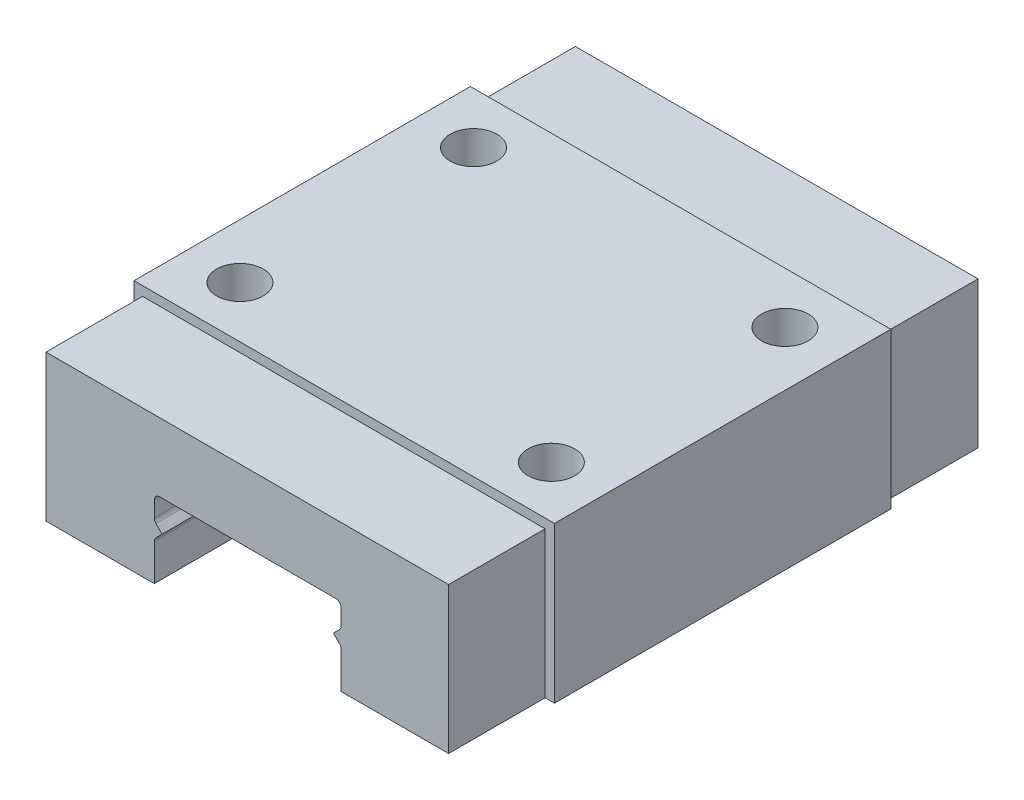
ISO-10303-21;
HEADER;
FILE_DESCRIPTION(('STEP AP214'),'2;1');
FILE_NAME('part.step','',(''),(''),'','','');
FILE_SCHEMA(('AUTOMOTIVE_DESIGN { 1 0 10303 214 1 1 1 1 }'));
ENDSEC;
DATA;
#1=APPLICATION_CONTEXT('core data for automotive mechanical design processes');
#2=APPLICATION_PROTOCOL_DEFINITION('international standard','automotive_design',2000,#1);
#3=PRODUCT_CONTEXT('',#1,'mechanical');
#4=PRODUCT('Part','Part','',(#3));
#5=PRODUCT_RELATED_PRODUCT_CATEGORY('part','',(#4));
#6=PRODUCT_DEFINITION_FORMATION('','',#4);
#7=PRODUCT_DEFINITION_CONTEXT('part definition',#1,'design');
#8=PRODUCT_DEFINITION('design','',#6,#7);
#9=PRODUCT_DEFINITION_SHAPE('','',#8);
#10=(LENGTH_UNIT() NAMED_UNIT(*) SI_UNIT(.MILLI.,.METRE.));
#11=(NAMED_UNIT(*) PLANE_ANGLE_UNIT() SI_UNIT($,.RADIAN.));
#12=(NAMED_UNIT(*) SI_UNIT($,.STERADIAN.) SOLID_ANGLE_UNIT());
#13=UNCERTAINTY_MEASURE_WITH_UNIT(LENGTH_MEASURE(1.E-05),#10,'distance_accuracy_value','');
#14=(GEOMETRIC_REPRESENTATION_CONTEXT(3) GLOBAL_UNCERTAINTY_ASSIGNED_CONTEXT((#13)) GLOBAL_UNIT_ASSIGNED_CONTEXT((#10,
#11,#12)) REPRESENTATION_CONTEXT('',''));
#15=CARTESIAN_POINT('',(0.,0.,0.));
#16=DIRECTION('',(0.,0.,1.));
#17=DIRECTION('',(1.,0.,0.));
#18=AXIS2_PLACEMENT_3D('',#15,#16,#17);
#19=CARTESIAN_POINT('',(-13.5,13.,34.));
#20=DIRECTION('',(1.,0.,0.));
#21=DIRECTION('',(0.,0.,-1.));
#22=AXIS2_PLACEMENT_3D('',#19,#20,#21);
#23=PLANE('',#22);
#24=DIRECTION('',(0.,-1.,0.));
#25=VECTOR('',#24,1.);
#26=CARTESIAN_POINT('',(-13.5,13.,27.8));
#27=LINE('',#26,#25);
#28=CARTESIAN_POINT('',(-13.5,13.,27.8));
#29=VERTEX_POINT('',#28);
#30=CARTESIAN_POINT('',(-13.5,3.,27.8));
#31=VERTEX_POINT('',#30);
#32=EDGE_CURVE('E462',#29,#31,#27,.T.);
#33=ORIENTED_EDGE('',*,*,#32,.F.);
#34=DIRECTION('',(0.,0.,-1.));
#35=VECTOR('',#34,1.);
#36=CARTESIAN_POINT('',(-13.5,13.,34.));
#37=LINE('',#36,#35);
#38=CARTESIAN_POINT('',(-13.5,13.,6.2));
#39=VERTEX_POINT('',#38);
#40=EDGE_CURVE('E56',#29,#39,#37,.T.);
#41=ORIENTED_EDGE('',*,*,#40,.T.);
#42=DIRECTION('',(0.,1.,0.));
#43=VECTOR('',#42,1.);
#44=CARTESIAN_POINT('',(-13.5,13.,6.2));
#45=LINE('',#44,#43);
#46=CARTESIAN_POINT('',(-13.5,3.,6.2));
#47=VERTEX_POINT('',#46);
#48=EDGE_CURVE('E479',#47,#39,#45,.T.);
#49=ORIENTED_EDGE('',*,*,#48,.F.);
#50=DIRECTION('',(0.,0.,-1.));
#51=VECTOR('',#50,1.);
#52=CARTESIAN_POINT('',(-13.5,3.,34.));
#53=LINE('',#52,#51);
#54=EDGE_CURVE('E267',#31,#47,#53,.T.);
#55=ORIENTED_EDGE('',*,*,#54,.F.);
#56=EDGE_LOOP('',(#33,#41,#49,#55));
#57=FACE_BOUND('',#56,.T.);
#58=ADVANCED_FACE('F34',(#57),#23,.F.);
#59=CARTESIAN_POINT('',(13.5,13.,34.));
#60=DIRECTION('',(-1.,0.,0.));
#61=DIRECTION('',(0.,0.,1.));
#62=AXIS2_PLACEMENT_3D('',#59,#60,#61);
#63=PLANE('',#62);
#64=DIRECTION('',(0.,1.,0.));
#65=VECTOR('',#64,1.);
#66=CARTESIAN_POINT('',(13.5,13.,27.8));
#67=LINE('',#66,#65);
#68=CARTESIAN_POINT('',(13.5,3.,27.8));
#69=VERTEX_POINT('',#68);
#70=CARTESIAN_POINT('',(13.5,13.,27.8));
#71=VERTEX_POINT('',#70);
#72=EDGE_CURVE('E1008',#69,#71,#67,.T.);
#73=ORIENTED_EDGE('',*,*,#72,.F.);
#74=DIRECTION('',(0.,0.,-1.));
#75=VECTOR('',#74,1.);
#76=CARTESIAN_POINT('',(13.5,3.,34.));
#77=LINE('',#76,#75);
#78=CARTESIAN_POINT('',(13.5,3.,6.2));
#79=VERTEX_POINT('',#78);
#80=EDGE_CURVE('E265',#69,#79,#77,.T.);
#81=ORIENTED_EDGE('',*,*,#80,.T.);
#82=DIRECTION('',(0.,-1.,0.));
#83=VECTOR('',#82,1.);
#84=CARTESIAN_POINT('',(13.5,13.,6.2));
#85=LINE('',#84,#83);
#86=CARTESIAN_POINT('',(13.5,13.,6.2));
#87=VERTEX_POINT('',#86);
#88=EDGE_CURVE('E476',#87,#79,#85,.T.);
#89=ORIENTED_EDGE('',*,*,#88,.F.);
#90=DIRECTION('',(0.,0.,-1.));
#91=VECTOR('',#90,1.);
#92=CARTESIAN_POINT('',(13.5,13.,34.));
#93=LINE('',#92,#91);
#94=EDGE_CURVE('E257',#71,#87,#93,.T.);
#95=ORIENTED_EDGE('',*,*,#94,.F.);
#96=EDGE_LOOP('',(#73,#81,#89,#95));
#97=FACE_BOUND('',#96,.T.);
#98=ADVANCED_FACE('F454',(#97),#63,.F.);
#99=CARTESIAN_POINT('',(-13.5,13.,34.));
#100=DIRECTION('',(0.,-1.,0.));
#101=DIRECTION('',(0.,0.,-1.));
#102=AXIS2_PLACEMENT_3D('',#99,#100,#101);
#103=PLANE('',#102);
#104=CARTESIAN_POINT('',(10.,13.,24.5));
#105=DIRECTION('',(0.,1.,0.));
#106=DIRECTION('',(0.,0.,1.));
#107=AXIS2_PLACEMENT_3D('',#104,#105,#106);
#108=CIRCLE('',#107,1.5);
#109=CARTESIAN_POINT('',(10.,13.,26.));
#110=VERTEX_POINT('',#109);
#111=EDGE_CURVE('E502',#110,#110,#108,.T.);
#112=ORIENTED_EDGE('',*,*,#111,.F.);
#113=EDGE_LOOP('',(#112));
#114=FACE_BOUND('',#113,.T.);
#115=CARTESIAN_POINT('',(10.,13.,9.5));
#116=DIRECTION('',(0.,1.,0.));
#117=DIRECTION('',(0.,0.,1.));
#118=AXIS2_PLACEMENT_3D('',#115,#116,#117);
#119=CIRCLE('',#118,1.5);
#120=CARTESIAN_POINT('',(10.,13.,11.));
#121=VERTEX_POINT('',#120);
#122=EDGE_CURVE('E514',#121,#121,#119,.T.);
#123=ORIENTED_EDGE('',*,*,#122,.F.);
#124=EDGE_LOOP('',(#123));
#125=FACE_BOUND('',#124,.T.);
#126=CARTESIAN_POINT('',(-10.,13.,24.5));
#127=DIRECTION('',(0.,1.,0.));
#128=DIRECTION('',(0.,0.,1.));
#129=AXIS2_PLACEMENT_3D('',#126,#127,#128);
#130=CIRCLE('',#129,1.5);
#131=CARTESIAN_POINT('',(-10.,13.,26.));
#132=VERTEX_POINT('',#131);
#133=EDGE_CURVE('E526',#132,#132,#130,.T.);
#134=ORIENTED_EDGE('',*,*,#133,.F.);
#135=EDGE_LOOP('',(#134));
#136=FACE_BOUND('',#135,.T.);
#137=CARTESIAN_POINT('',(-10.,13.,9.5));
#138=DIRECTION('',(0.,1.,0.));
#139=DIRECTION('',(0.,0.,1.));
#140=AXIS2_PLACEMENT_3D('',#137,#138,#139);
#141=CIRCLE('',#140,1.5);
#142=CARTESIAN_POINT('',(-10.,13.,11.));
#143=VERTEX_POINT('',#142);
#144=EDGE_CURVE('E338',#143,#143,#141,.T.);
#145=ORIENTED_EDGE('',*,*,#144,.F.);
#146=EDGE_LOOP('',(#145));
#147=FACE_BOUND('',#146,.T.);
#148=DIRECTION('',(-1.,0.,0.));
#149=VECTOR('',#148,1.);
#150=CARTESIAN_POINT('',(-13.5,13.,27.8));
#151=LINE('',#150,#149);
#152=EDGE_CURVE('E465',#71,#29,#151,.T.);
#153=ORIENTED_EDGE('',*,*,#152,.F.);
#154=ORIENTED_EDGE('',*,*,#94,.T.);
#155=DIRECTION('',(1.,0.,0.));
#156=VECTOR('',#155,1.);
#157=CARTESIAN_POINT('',(-13.5,13.,6.2));
#158=LINE('',#157,#156);
#159=EDGE_CURVE('E472',#39,#87,#158,.T.);
#160=ORIENTED_EDGE('',*,*,#159,.F.);
#161=ORIENTED_EDGE('',*,*,#40,.F.);
#162=EDGE_LOOP('',(#153,#154,#160,#161));
#163=FACE_BOUND('',#162,.T.);
#164=ADVANCED_FACE('F458',(#114,#125,#136,#147,#163),#103,.F.);
#165=CARTESIAN_POINT('',(-13.5,3.,34.));
#166=DIRECTION('',(0.,1.,0.));
#167=DIRECTION('',(0.,0.,1.));
#168=AXIS2_PLACEMENT_3D('',#165,#166,#167);
#169=PLANE('',#168);
#170=DIRECTION('',(1.,0.,0.));
#171=VECTOR('',#170,1.);
#172=CARTESIAN_POINT('',(-13.5,3.,34.));
#173=LINE('',#172,#171);
#174=CARTESIAN_POINT('',(6.,3.,34.));
#175=VERTEX_POINT('',#174);
#176=CARTESIAN_POINT('',(12.9,3.,34.));
#177=VERTEX_POINT('',#176);
#178=EDGE_CURVE('E255',#175,#177,#173,.T.);
#179=ORIENTED_EDGE('',*,*,#178,.F.);
#180=DIRECTION('',(0.,0.,1.));
#181=VECTOR('',#180,1.);
#182=CARTESIAN_POINT('',(6.,3.,34.));
#183=LINE('',#182,#181);
#184=CARTESIAN_POINT('',(6.,3.,0.));
#185=VERTEX_POINT('',#184);
#186=EDGE_CURVE('E363',#185,#175,#183,.T.);
#187=ORIENTED_EDGE('',*,*,#186,.F.);
#188=DIRECTION('',(1.,0.,0.));
#189=VECTOR('',#188,1.);
#190=CARTESIAN_POINT('',(-13.5,3.,0.));
#191=LINE('',#190,#189);
#192=CARTESIAN_POINT('',(12.9,3.,0.));
#193=VERTEX_POINT('',#192);
#194=EDGE_CURVE('E391',#185,#193,#191,.T.);
#195=ORIENTED_EDGE('',*,*,#194,.T.);
#196=DIRECTION('',(0.,0.,-1.));
#197=VECTOR('',#196,1.);
#198=CARTESIAN_POINT('',(12.9,3.,6.2));
#199=LINE('',#198,#197);
#200=CARTESIAN_POINT('',(12.9,3.,6.2));
#201=VERTEX_POINT('',#200);
#202=EDGE_CURVE('E484',#201,#193,#199,.T.);
#203=ORIENTED_EDGE('',*,*,#202,.F.);
#204=DIRECTION('',(-1.,0.,0.));
#205=VECTOR('',#204,1.);
#206=CARTESIAN_POINT('',(-13.5,3.,6.2));
#207=LINE('',#206,#205);
#208=EDGE_CURVE('E488',#79,#201,#207,.T.);
#209=ORIENTED_EDGE('',*,*,#208,.F.);
#210=ORIENTED_EDGE('',*,*,#80,.F.);
#211=DIRECTION('',(1.,0.,0.));
#212=VECTOR('',#211,1.);
#213=CARTESIAN_POINT('',(-13.5,3.,27.8));
#214=LINE('',#213,#212);
#215=CARTESIAN_POINT('',(12.9,3.,27.8));
#216=VERTEX_POINT('',#215);
#217=EDGE_CURVE('E1003',#216,#69,#214,.T.);
#218=ORIENTED_EDGE('',*,*,#217,.F.);
#219=DIRECTION('',(0.,0.,1.));
#220=VECTOR('',#219,1.);
#221=CARTESIAN_POINT('',(12.9,3.,27.8));
#222=LINE('',#221,#220);
#223=EDGE_CURVE('E237',#216,#177,#222,.T.);
#224=ORIENTED_EDGE('',*,*,#223,.T.);
#225=EDGE_LOOP('',(#179,#187,#195,#203,#209,#210,#218,#224));
#226=FACE_BOUND('',#225,.T.);
#227=ADVANCED_FACE('F549',(#226),#169,.F.);
#228=CARTESIAN_POINT('',(-13.5,3.,0.));
#229=DIRECTION('',(0.,0.,1.));
#230=DIRECTION('',(1.,0.,0.));
#231=AXIS2_PLACEMENT_3D('',#228,#229,#230);
#232=PLANE('',#231);
#233=DIRECTION('',(0.,-1.,0.));
#234=VECTOR('',#233,1.);
#235=CARTESIAN_POINT('',(12.9,12.4,0.));
#236=LINE('',#235,#234);
#237=CARTESIAN_POINT('',(12.9,12.4,0.));
#238=VERTEX_POINT('',#237);
#239=EDGE_CURVE('E1012',#238,#193,#236,.T.);
#240=ORIENTED_EDGE('',*,*,#239,.T.);
#241=ORIENTED_EDGE('',*,*,#194,.F.);
#242=DIRECTION('',(0.,1.,0.));
#243=VECTOR('',#242,1.);
#244=CARTESIAN_POINT('',(6.,0.830210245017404,0.));
#245=LINE('',#244,#243);
#246=CARTESIAN_POINT('',(6.,5.35502525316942,0.));
#247=VERTEX_POINT('',#246);
#248=EDGE_CURVE('E356',#185,#247,#245,.T.);
#249=ORIENTED_EDGE('',*,*,#248,.T.);
#250=CARTESIAN_POINT('',(5.65,5.35502525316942,0.));
#251=DIRECTION('',(0.,0.,1.));
#252=DIRECTION('',(1.,0.,0.));
#253=AXIS2_PLACEMENT_3D('',#250,#251,#252);
#254=CIRCLE('',#253,0.35);
#255=CARTESIAN_POINT('',(5.89748737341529,5.60251262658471,0.));
#256=VERTEX_POINT('',#255);
#257=EDGE_CURVE('E314',#247,#256,#254,.T.);
#258=ORIENTED_EDGE('',*,*,#257,.T.);
#259=DIRECTION('',(-0.707106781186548,0.707106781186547,0.));
#260=VECTOR('',#259,1.);
#261=CARTESIAN_POINT('',(5.5,6.,0.));
#262=LINE('',#261,#260);
#263=CARTESIAN_POINT('',(5.5,6.,0.));
#264=VERTEX_POINT('',#263);
#265=EDGE_CURVE('E541',#256,#264,#262,.T.);
#266=ORIENTED_EDGE('',*,*,#265,.T.);
#267=DIRECTION('',(0.707106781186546,0.707106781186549,0.));
#268=VECTOR('',#267,1.);
#269=CARTESIAN_POINT('',(6.,6.5,0.));
#270=LINE('',#269,#268);
#271=CARTESIAN_POINT('',(5.89748737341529,6.39748737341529,0.));
#272=VERTEX_POINT('',#271);
#273=EDGE_CURVE('E329',#264,#272,#270,.T.);
#274=ORIENTED_EDGE('',*,*,#273,.T.);
#275=CARTESIAN_POINT('',(5.65,6.64497474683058,0.));
#276=DIRECTION('',(0.,0.,1.));
#277=DIRECTION('',(1.,0.,0.));
#278=AXIS2_PLACEMENT_3D('',#275,#276,#277);
#279=CIRCLE('',#278,0.35);
#280=CARTESIAN_POINT('',(6.,6.64497474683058,0.));
#281=VERTEX_POINT('',#280);
#282=EDGE_CURVE('E41',#272,#281,#279,.T.);
#283=ORIENTED_EDGE('',*,*,#282,.T.);
#284=DIRECTION('',(0.,1.,0.));
#285=VECTOR('',#284,1.);
#286=CARTESIAN_POINT('',(6.,8.,0.));
#287=LINE('',#286,#285);
#288=CARTESIAN_POINT('',(6.,7.65,0.));
#289=VERTEX_POINT('',#288);
#290=EDGE_CURVE('E327',#281,#289,#287,.T.);
#291=ORIENTED_EDGE('',*,*,#290,.T.);
#292=CARTESIAN_POINT('',(5.65,7.65,0.));
#293=DIRECTION('',(0.,0.,1.));
#294=DIRECTION('',(1.,0.,0.));
#295=AXIS2_PLACEMENT_3D('',#292,#293,#294);
#296=CIRCLE('',#295,0.35);
#297=CARTESIAN_POINT('',(5.65,8.,0.));
#298=VERTEX_POINT('',#297);
#299=EDGE_CURVE('E318',#289,#298,#296,.T.);
#300=ORIENTED_EDGE('',*,*,#299,.T.);
#301=DIRECTION('',(1.,0.,0.));
#302=VECTOR('',#301,1.);
#303=CARTESIAN_POINT('',(0.,8.,0.));
#304=LINE('',#303,#302);
#305=CARTESIAN_POINT('',(-5.65,8.,0.));
#306=VERTEX_POINT('',#305);
#307=EDGE_CURVE('E373',#306,#298,#304,.T.);
#308=ORIENTED_EDGE('',*,*,#307,.F.);
#309=CARTESIAN_POINT('',(-5.65,7.65,0.));
#310=DIRECTION('',(0.,0.,1.));
#311=DIRECTION('',(1.,0.,0.));
#312=AXIS2_PLACEMENT_3D('',#309,#310,#311);
#313=CIRCLE('',#312,0.35);
#314=CARTESIAN_POINT('',(-6.,7.65,0.));
#315=VERTEX_POINT('',#314);
#316=EDGE_CURVE('E291',#306,#315,#313,.T.);
#317=ORIENTED_EDGE('',*,*,#316,.T.);
#318=DIRECTION('',(0.,1.,0.));
#319=VECTOR('',#318,1.);
#320=CARTESIAN_POINT('',(-6.,8.,0.));
#321=LINE('',#320,#319);
#322=CARTESIAN_POINT('',(-6.,6.64497474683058,0.));
#323=VERTEX_POINT('',#322);
#324=EDGE_CURVE('E370',#323,#315,#321,.T.);
#325=ORIENTED_EDGE('',*,*,#324,.F.);
#326=CARTESIAN_POINT('',(-5.65,6.64497474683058,0.));
#327=DIRECTION('',(0.,0.,1.));
#328=DIRECTION('',(1.,0.,0.));
#329=AXIS2_PLACEMENT_3D('',#326,#327,#328);
#330=CIRCLE('',#329,0.35);
#331=CARTESIAN_POINT('',(-5.89748737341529,6.39748737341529,0.));
#332=VERTEX_POINT('',#331);
#333=EDGE_CURVE('E295',#323,#332,#330,.T.);
#334=ORIENTED_EDGE('',*,*,#333,.T.);
#335=DIRECTION('',(-0.707106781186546,0.707106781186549,0.));
#336=VECTOR('',#335,1.);
#337=CARTESIAN_POINT('',(-6.,6.5,0.));
#338=LINE('',#337,#336);
#339=CARTESIAN_POINT('',(-5.5,6.,0.));
#340=VERTEX_POINT('',#339);
#341=EDGE_CURVE('E367',#340,#332,#338,.T.);
#342=ORIENTED_EDGE('',*,*,#341,.F.);
#343=DIRECTION('',(0.707106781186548,0.707106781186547,0.));
#344=VECTOR('',#343,1.);
#345=CARTESIAN_POINT('',(-5.5,6.,0.));
#346=LINE('',#345,#344);
#347=CARTESIAN_POINT('',(-5.89748737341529,5.60251262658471,0.));
#348=VERTEX_POINT('',#347);
#349=EDGE_CURVE('E365',#348,#340,#346,.T.);
#350=ORIENTED_EDGE('',*,*,#349,.F.);
#351=CARTESIAN_POINT('',(-5.65,5.35502525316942,0.));
#352=DIRECTION('',(0.,0.,1.));
#353=DIRECTION('',(1.,0.,0.));
#354=AXIS2_PLACEMENT_3D('',#351,#352,#353);
#355=CIRCLE('',#354,0.35);
#356=CARTESIAN_POINT('',(-6.,5.35502525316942,0.));
#357=VERTEX_POINT('',#356);
#358=EDGE_CURVE('E287',#348,#357,#355,.T.);
#359=ORIENTED_EDGE('',*,*,#358,.T.);
#360=DIRECTION('',(0.,-1.,0.));
#361=VECTOR('',#360,1.);
#362=CARTESIAN_POINT('',(-6.,3.,0.));
#363=LINE('',#362,#361);
#364=CARTESIAN_POINT('',(-6.,3.,0.));
#365=VERTEX_POINT('',#364);
#366=EDGE_CURVE('E269',#357,#365,#363,.T.);
#367=ORIENTED_EDGE('',*,*,#366,.T.);
#368=CARTESIAN_POINT('',(-12.9556650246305,3.,0.));
#369=VERTEX_POINT('',#368);
#370=EDGE_CURVE('E260',#369,#365,#191,.T.);
#371=ORIENTED_EDGE('',*,*,#370,.F.);
#372=DIRECTION('',(0.,1.,0.));
#373=VECTOR('',#372,1.);
#374=CARTESIAN_POINT('',(-12.9556650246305,12.4,0.));
#375=LINE('',#374,#373);
#376=CARTESIAN_POINT('',(-12.9556650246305,12.4,0.));
#377=VERTEX_POINT('',#376);
#378=EDGE_CURVE('E1014',#369,#377,#375,.T.);
#379=ORIENTED_EDGE('',*,*,#378,.T.);
#380=DIRECTION('',(1.,0.,0.));
#381=VECTOR('',#380,1.);
#382=CARTESIAN_POINT('',(12.9,12.4,0.));
#383=LINE('',#382,#381);
#384=EDGE_CURVE('E1016',#377,#238,#383,.T.);
#385=ORIENTED_EDGE('',*,*,#384,.T.);
#386=EDGE_LOOP('',(#240,#241,#249,#258,#266,#274,#283,#291,#300,#308,#317,#325,#334,#342,#350,
#359,#367,#371,#379,#385));
#387=FACE_BOUND('',#386,.T.);
#388=ADVANCED_FACE('F326',(#387),#232,.F.);
#389=DIRECTION('',(0.,0.,1.));
#390=VECTOR('',#389,1.);
#391=CARTESIAN_POINT('',(-12.9556650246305,3.,27.8));
#392=LINE('',#391,#390);
#393=CARTESIAN_POINT('',(-12.9556650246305,3.,27.8));
#394=VERTEX_POINT('',#393);
#395=CARTESIAN_POINT('',(-12.9556650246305,3.,34.));
#396=VERTEX_POINT('',#395);
#397=EDGE_CURVE('E230',#394,#396,#392,.T.);
#398=ORIENTED_EDGE('',*,*,#397,.F.);
#399=DIRECTION('',(1.,0.,0.));
#400=VECTOR('',#399,1.);
#401=CARTESIAN_POINT('',(-13.5,3.,27.8));
#402=LINE('',#401,#400);
#403=EDGE_CURVE('E464',#31,#394,#402,.T.);
#404=ORIENTED_EDGE('',*,*,#403,.F.);
#405=ORIENTED_EDGE('',*,*,#54,.T.);
#406=DIRECTION('',(-1.,0.,0.));
#407=VECTOR('',#406,1.);
#408=CARTESIAN_POINT('',(-13.5,3.,6.2));
#409=LINE('',#408,#407);
#410=CARTESIAN_POINT('',(-12.9556650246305,3.,6.2));
#411=VERTEX_POINT('',#410);
#412=EDGE_CURVE('E490',#411,#47,#409,.T.);
#413=ORIENTED_EDGE('',*,*,#412,.F.);
#414=DIRECTION('',(0.,0.,-1.));
#415=VECTOR('',#414,1.);
#416=CARTESIAN_POINT('',(-12.9556650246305,3.,6.2));
#417=LINE('',#416,#415);
#418=EDGE_CURVE('E401',#411,#369,#417,.T.);
#419=ORIENTED_EDGE('',*,*,#418,.T.);
#420=ORIENTED_EDGE('',*,*,#370,.T.);
#421=DIRECTION('',(0.,0.,1.));
#422=VECTOR('',#421,1.);
#423=CARTESIAN_POINT('',(-6.,3.,34.));
#424=LINE('',#423,#422);
#425=CARTESIAN_POINT('',(-6.,3.,34.));
#426=VERTEX_POINT('',#425);
#427=EDGE_CURVE('E254',#365,#426,#424,.T.);
#428=ORIENTED_EDGE('',*,*,#427,.T.);
#429=EDGE_CURVE('E246',#396,#426,#173,.T.);
#430=ORIENTED_EDGE('',*,*,#429,.F.);
#431=EDGE_LOOP('',(#398,#404,#405,#413,#419,#420,#428,#430));
#432=FACE_BOUND('',#431,.T.);
#433=ADVANCED_FACE('F252',(#432),#169,.F.);
#434=CARTESIAN_POINT('',(-13.5,3.,34.));
#435=DIRECTION('',(0.,0.,1.));
#436=DIRECTION('',(1.,0.,0.));
#437=AXIS2_PLACEMENT_3D('',#434,#435,#436);
#438=PLANE('',#437);
#439=DIRECTION('',(0.,-1.,0.));
#440=VECTOR('',#439,1.);
#441=CARTESIAN_POINT('',(12.9,12.4,34.));
#442=LINE('',#441,#440);
#443=CARTESIAN_POINT('',(12.9,12.4,34.));
#444=VERTEX_POINT('',#443);
#445=EDGE_CURVE('E553',#444,#177,#442,.T.);
#446=ORIENTED_EDGE('',*,*,#445,.F.);
#447=DIRECTION('',(1.,0.,0.));
#448=VECTOR('',#447,1.);
#449=CARTESIAN_POINT('',(12.9,12.4,34.));
#450=LINE('',#449,#448);
#451=CARTESIAN_POINT('',(-12.9556650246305,12.4,34.));
#452=VERTEX_POINT('',#451);
#453=EDGE_CURVE('E249',#452,#444,#450,.T.);
#454=ORIENTED_EDGE('',*,*,#453,.F.);
#455=DIRECTION('',(0.,1.,0.));
#456=VECTOR('',#455,1.);
#457=CARTESIAN_POINT('',(-12.9556650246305,12.4,34.));
#458=LINE('',#457,#456);
#459=EDGE_CURVE('E48',#396,#452,#458,.T.);
#460=ORIENTED_EDGE('',*,*,#459,.F.);
#461=ORIENTED_EDGE('',*,*,#429,.T.);
#462=DIRECTION('',(0.,1.,0.));
#463=VECTOR('',#462,1.);
#464=CARTESIAN_POINT('',(-6.,0.830210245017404,34.));
#465=LINE('',#464,#463);
#466=CARTESIAN_POINT('',(-6.,5.35502525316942,34.));
#467=VERTEX_POINT('',#466);
#468=EDGE_CURVE('E376',#426,#467,#465,.T.);
#469=ORIENTED_EDGE('',*,*,#468,.T.);
#470=CARTESIAN_POINT('',(-5.65,5.35502525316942,34.));
#471=DIRECTION('',(0.,0.,1.));
#472=DIRECTION('',(1.,0.,0.));
#473=AXIS2_PLACEMENT_3D('',#470,#471,#472);
#474=CIRCLE('',#473,0.35);
#475=CARTESIAN_POINT('',(-5.89748737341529,5.60251262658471,34.));
#476=VERTEX_POINT('',#475);
#477=EDGE_CURVE('E289',#467,#476,#474,.F.);
#478=ORIENTED_EDGE('',*,*,#477,.T.);
#479=DIRECTION('',(0.707106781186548,0.707106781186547,0.));
#480=VECTOR('',#479,1.);
#481=CARTESIAN_POINT('',(-5.5,6.,34.));
#482=LINE('',#481,#480);
#483=CARTESIAN_POINT('',(-5.5,6.,34.));
#484=VERTEX_POINT('',#483);
#485=EDGE_CURVE('E378',#476,#484,#482,.T.);
#486=ORIENTED_EDGE('',*,*,#485,.T.);
#487=DIRECTION('',(-0.707106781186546,0.707106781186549,0.));
#488=VECTOR('',#487,1.);
#489=CARTESIAN_POINT('',(-6.,6.5,34.));
#490=LINE('',#489,#488);
#491=CARTESIAN_POINT('',(-5.89748737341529,6.39748737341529,34.));
#492=VERTEX_POINT('',#491);
#493=EDGE_CURVE('E380',#484,#492,#490,.T.);
#494=ORIENTED_EDGE('',*,*,#493,.T.);
#495=CARTESIAN_POINT('',(-5.65,6.64497474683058,34.));
#496=DIRECTION('',(0.,0.,1.));
#497=DIRECTION('',(1.,0.,0.));
#498=AXIS2_PLACEMENT_3D('',#495,#496,#497);
#499=CIRCLE('',#498,0.35);
#500=CARTESIAN_POINT('',(-6.,6.64497474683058,34.));
#501=VERTEX_POINT('',#500);
#502=EDGE_CURVE('E297',#492,#501,#499,.F.);
#503=ORIENTED_EDGE('',*,*,#502,.T.);
#504=DIRECTION('',(0.,1.,0.));
#505=VECTOR('',#504,1.);
#506=CARTESIAN_POINT('',(-6.,8.,34.));
#507=LINE('',#506,#505);
#508=CARTESIAN_POINT('',(-6.,7.65,34.));
#509=VERTEX_POINT('',#508);
#510=EDGE_CURVE('E383',#501,#509,#507,.T.);
#511=ORIENTED_EDGE('',*,*,#510,.T.);
#512=CARTESIAN_POINT('',(-5.65,7.65,34.));
#513=DIRECTION('',(0.,0.,1.));
#514=DIRECTION('',(1.,0.,0.));
#515=AXIS2_PLACEMENT_3D('',#512,#513,#514);
#516=CIRCLE('',#515,0.35);
#517=CARTESIAN_POINT('',(-5.65,8.,34.));
#518=VERTEX_POINT('',#517);
#519=EDGE_CURVE('E293',#509,#518,#516,.F.);
#520=ORIENTED_EDGE('',*,*,#519,.T.);
#521=DIRECTION('',(1.,0.,0.));
#522=VECTOR('',#521,1.);
#523=CARTESIAN_POINT('',(0.,8.,34.));
#524=LINE('',#523,#522);
#525=CARTESIAN_POINT('',(5.65,8.,34.));
#526=VERTEX_POINT('',#525);
#527=EDGE_CURVE('E386',#518,#526,#524,.T.);
#528=ORIENTED_EDGE('',*,*,#527,.T.);
#529=CARTESIAN_POINT('',(5.65,7.65,34.));
#530=DIRECTION('',(0.,0.,1.));
#531=DIRECTION('',(1.,0.,0.));
#532=AXIS2_PLACEMENT_3D('',#529,#530,#531);
#533=CIRCLE('',#532,0.35);
#534=CARTESIAN_POINT('',(6.,7.65,34.));
#535=VERTEX_POINT('',#534);
#536=EDGE_CURVE('E320',#526,#535,#533,.F.);
#537=ORIENTED_EDGE('',*,*,#536,.T.);
#538=DIRECTION('',(0.,1.,0.));
#539=VECTOR('',#538,1.);
#540=CARTESIAN_POINT('',(6.,8.,34.));
#541=LINE('',#540,#539);
#542=CARTESIAN_POINT('',(6.,6.64497474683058,34.));
#543=VERTEX_POINT('',#542);
#544=EDGE_CURVE('E346',#543,#535,#541,.T.);
#545=ORIENTED_EDGE('',*,*,#544,.F.);
#546=CARTESIAN_POINT('',(5.65,6.64497474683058,34.));
#547=DIRECTION('',(0.,0.,1.));
#548=DIRECTION('',(1.,0.,0.));
#549=AXIS2_PLACEMENT_3D('',#546,#547,#548);
#550=CIRCLE('',#549,0.35);
#551=CARTESIAN_POINT('',(5.89748737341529,6.39748737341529,34.));
#552=VERTEX_POINT('',#551);
#553=EDGE_CURVE('E12',#543,#552,#550,.F.);
#554=ORIENTED_EDGE('',*,*,#553,.T.);
#555=DIRECTION('',(0.707106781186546,0.707106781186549,0.));
#556=VECTOR('',#555,1.);
#557=CARTESIAN_POINT('',(6.,6.5,34.));
#558=LINE('',#557,#556);
#559=CARTESIAN_POINT('',(5.5,6.,34.));
#560=VERTEX_POINT('',#559);
#561=EDGE_CURVE('E345',#560,#552,#558,.T.);
#562=ORIENTED_EDGE('',*,*,#561,.F.);
#563=DIRECTION('',(-0.707106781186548,0.707106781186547,0.));
#564=VECTOR('',#563,1.);
#565=CARTESIAN_POINT('',(5.5,6.,34.));
#566=LINE('',#565,#564);
#567=CARTESIAN_POINT('',(5.89748737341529,5.60251262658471,34.));
#568=VERTEX_POINT('',#567);
#569=EDGE_CURVE('E352',#568,#560,#566,.T.);
#570=ORIENTED_EDGE('',*,*,#569,.F.);
#571=CARTESIAN_POINT('',(5.65,5.35502525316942,34.));
#572=DIRECTION('',(0.,0.,1.));
#573=DIRECTION('',(1.,0.,0.));
#574=AXIS2_PLACEMENT_3D('',#571,#572,#573);
#575=CIRCLE('',#574,0.35);
#576=CARTESIAN_POINT('',(6.,5.35502525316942,34.));
#577=VERTEX_POINT('',#576);
#578=EDGE_CURVE('E316',#568,#577,#575,.F.);
#579=ORIENTED_EDGE('',*,*,#578,.T.);
#580=DIRECTION('',(0.,1.,0.));
#581=VECTOR('',#580,1.);
#582=CARTESIAN_POINT('',(6.,0.830210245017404,34.));
#583=LINE('',#582,#581);
#584=EDGE_CURVE('E354',#175,#577,#583,.T.);
#585=ORIENTED_EDGE('',*,*,#584,.F.);
#586=ORIENTED_EDGE('',*,*,#178,.T.);
#587=EDGE_LOOP('',(#446,#454,#460,#461,#469,#478,#486,#494,#503,#511,#520,#528,#537,#545,#554,
#562,#570,#579,#585,#586));
#588=FACE_BOUND('',#587,.T.);
#589=ADVANCED_FACE('F244',(#588),#438,.T.);
#590=CARTESIAN_POINT('',(-6.,0.830210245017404,34.));
#591=DIRECTION('',(-1.,0.,0.));
#592=DIRECTION('',(0.,0.,1.));
#593=AXIS2_PLACEMENT_3D('',#590,#591,#592);
#594=PLANE('',#593);
#595=ORIENTED_EDGE('',*,*,#366,.F.);
#596=DIRECTION('',(0.,0.,-1.));
#597=VECTOR('',#596,1.);
#598=CARTESIAN_POINT('',(-6.,5.35502525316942,34.));
#599=LINE('',#598,#597);
#600=EDGE_CURVE('E275',#357,#467,#599,.F.);
#601=ORIENTED_EDGE('',*,*,#600,.T.);
#602=ORIENTED_EDGE('',*,*,#468,.F.);
#603=ORIENTED_EDGE('',*,*,#427,.F.);
#604=EDGE_LOOP('',(#595,#601,#602,#603));
#605=FACE_BOUND('',#604,.T.);
#606=ADVANCED_FACE('F407',(#605),#594,.F.);
#607=CARTESIAN_POINT('',(0.,8.,34.));
#608=DIRECTION('',(0.,1.,0.));
#609=DIRECTION('',(0.,0.,1.));
#610=AXIS2_PLACEMENT_3D('',#607,#608,#609);
#611=PLANE('',#610);
#612=ORIENTED_EDGE('',*,*,#307,.T.);
#613=DIRECTION('',(0.,0.,-1.));
#614=VECTOR('',#613,1.);
#615=CARTESIAN_POINT('',(5.65,8.,34.));
#616=LINE('',#615,#614);
#617=EDGE_CURVE('E309',#298,#526,#616,.F.);
#618=ORIENTED_EDGE('',*,*,#617,.T.);
#619=ORIENTED_EDGE('',*,*,#527,.F.);
#620=DIRECTION('',(0.,0.,-1.));
#621=VECTOR('',#620,1.);
#622=CARTESIAN_POINT('',(-5.65,8.,0.));
#623=LINE('',#622,#621);
#624=EDGE_CURVE('E277',#518,#306,#623,.T.);
#625=ORIENTED_EDGE('',*,*,#624,.T.);
#626=EDGE_LOOP('',(#612,#618,#619,#625));
#627=FACE_BOUND('',#626,.T.);
#628=ADVANCED_FACE('F437',(#627),#611,.F.);
#629=CARTESIAN_POINT('',(-6.,8.,34.));
#630=DIRECTION('',(-1.,0.,0.));
#631=DIRECTION('',(0.,0.,1.));
#632=AXIS2_PLACEMENT_3D('',#629,#630,#631);
#633=PLANE('',#632);
#634=ORIENTED_EDGE('',*,*,#324,.T.);
#635=DIRECTION('',(0.,0.,-1.));
#636=VECTOR('',#635,1.);
#637=CARTESIAN_POINT('',(-6.,7.65,34.));
#638=LINE('',#637,#636);
#639=EDGE_CURVE('E283',#315,#509,#638,.F.);
#640=ORIENTED_EDGE('',*,*,#639,.T.);
#641=ORIENTED_EDGE('',*,*,#510,.F.);
#642=DIRECTION('',(0.,0.,-1.));
#643=VECTOR('',#642,1.);
#644=CARTESIAN_POINT('',(-6.,6.64497474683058,0.));
#645=LINE('',#644,#643);
#646=EDGE_CURVE('E280',#501,#323,#645,.T.);
#647=ORIENTED_EDGE('',*,*,#646,.T.);
#648=EDGE_LOOP('',(#634,#640,#641,#647));
#649=FACE_BOUND('',#648,.T.);
#650=ADVANCED_FACE('F429',(#649),#633,.F.);
#651=CARTESIAN_POINT('',(-6.,6.5,34.));
#652=DIRECTION('',(-0.707106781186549,-0.707106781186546,0.));
#653=DIRECTION('',(0.707106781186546,-0.707106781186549,0.));
#654=AXIS2_PLACEMENT_3D('',#651,#652,#653);
#655=PLANE('',#654);
#656=ORIENTED_EDGE('',*,*,#341,.T.);
#657=DIRECTION('',(0.,0.,-1.));
#658=VECTOR('',#657,1.);
#659=CARTESIAN_POINT('',(-5.89748737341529,6.39748737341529,34.));
#660=LINE('',#659,#658);
#661=EDGE_CURVE('E285',#332,#492,#660,.F.);
#662=ORIENTED_EDGE('',*,*,#661,.T.);
#663=ORIENTED_EDGE('',*,*,#493,.F.);
#664=DIRECTION('',(0.,0.,-1.));
#665=VECTOR('',#664,1.);
#666=CARTESIAN_POINT('',(-5.5,6.,34.));
#667=LINE('',#666,#665);
#668=EDGE_CURVE('E389',#484,#340,#667,.T.);
#669=ORIENTED_EDGE('',*,*,#668,.T.);
#670=EDGE_LOOP('',(#656,#662,#663,#669));
#671=FACE_BOUND('',#670,.T.);
#672=ADVANCED_FACE('F420',(#671),#655,.F.);
#673=CARTESIAN_POINT('',(-5.5,6.,34.));
#674=DIRECTION('',(-0.707106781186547,0.707106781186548,0.));
#675=DIRECTION('',(-0.707106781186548,-0.707106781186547,0.));
#676=AXIS2_PLACEMENT_3D('',#673,#674,#675);
#677=PLANE('',#676);
#678=ORIENTED_EDGE('',*,*,#485,.F.);
#679=DIRECTION('',(0.,0.,-1.));
#680=VECTOR('',#679,1.);
#681=CARTESIAN_POINT('',(-5.89748737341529,5.60251262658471,0.));
#682=LINE('',#681,#680);
#683=EDGE_CURVE('E272',#476,#348,#682,.T.);
#684=ORIENTED_EDGE('',*,*,#683,.T.);
#685=ORIENTED_EDGE('',*,*,#349,.T.);
#686=ORIENTED_EDGE('',*,*,#668,.F.);
#687=EDGE_LOOP('',(#678,#684,#685,#686));
#688=FACE_BOUND('',#687,.T.);
#689=ADVANCED_FACE('F414',(#688),#677,.F.);
#690=CARTESIAN_POINT('',(-5.65,5.35502525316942,34.));
#691=DIRECTION('',(0.,0.,1.));
#692=DIRECTION('',(1.,0.,0.));
#693=AXIS2_PLACEMENT_3D('',#690,#691,#692);
#694=CYLINDRICAL_SURFACE('',#693,0.35);
#695=ORIENTED_EDGE('',*,*,#477,.F.);
#696=ORIENTED_EDGE('',*,*,#600,.F.);
#697=ORIENTED_EDGE('',*,*,#358,.F.);
#698=ORIENTED_EDGE('',*,*,#683,.F.);
#699=EDGE_LOOP('',(#695,#696,#697,#698));
#700=FACE_BOUND('',#699,.T.);
#701=ADVANCED_FACE('F412',(#700),#694,.F.);
#702=CARTESIAN_POINT('',(-5.65,7.65,34.));
#703=DIRECTION('',(0.,0.,1.));
#704=DIRECTION('',(1.,0.,0.));
#705=AXIS2_PLACEMENT_3D('',#702,#703,#704);
#706=CYLINDRICAL_SURFACE('',#705,0.35);
#707=ORIENTED_EDGE('',*,*,#519,.F.);
#708=ORIENTED_EDGE('',*,*,#639,.F.);
#709=ORIENTED_EDGE('',*,*,#316,.F.);
#710=ORIENTED_EDGE('',*,*,#624,.F.);
#711=EDGE_LOOP('',(#707,#708,#709,#710));
#712=FACE_BOUND('',#711,.T.);
#713=ADVANCED_FACE('F432',(#712),#706,.F.);
#714=CARTESIAN_POINT('',(-5.65,6.64497474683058,34.));
#715=DIRECTION('',(0.,0.,1.));
#716=DIRECTION('',(1.,0.,0.));
#717=AXIS2_PLACEMENT_3D('',#714,#715,#716);
#718=CYLINDRICAL_SURFACE('',#717,0.35);
#719=ORIENTED_EDGE('',*,*,#502,.F.);
#720=ORIENTED_EDGE('',*,*,#661,.F.);
#721=ORIENTED_EDGE('',*,*,#333,.F.);
#722=ORIENTED_EDGE('',*,*,#646,.F.);
#723=EDGE_LOOP('',(#719,#720,#721,#722));
#724=FACE_BOUND('',#723,.T.);
#725=ADVANCED_FACE('F424',(#724),#718,.F.);
#726=CARTESIAN_POINT('',(6.,0.830210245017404,34.));
#727=DIRECTION('',(-1.,0.,0.));
#728=DIRECTION('',(0.,0.,1.));
#729=AXIS2_PLACEMENT_3D('',#726,#727,#728);
#730=PLANE('',#729);
#731=ORIENTED_EDGE('',*,*,#584,.T.);
#732=DIRECTION('',(0.,0.,-1.));
#733=VECTOR('',#732,1.);
#734=CARTESIAN_POINT('',(6.,5.35502525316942,0.));
#735=LINE('',#734,#733);
#736=EDGE_CURVE('E299',#577,#247,#735,.T.);
#737=ORIENTED_EDGE('',*,*,#736,.T.);
#738=ORIENTED_EDGE('',*,*,#248,.F.);
#739=ORIENTED_EDGE('',*,*,#186,.T.);
#740=EDGE_LOOP('',(#731,#737,#738,#739));
#741=FACE_BOUND('',#740,.T.);
#742=ADVANCED_FACE('F545',(#741),#730,.T.);
#743=CARTESIAN_POINT('',(5.5,6.,34.));
#744=DIRECTION('',(-0.707106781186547,-0.707106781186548,0.));
#745=DIRECTION('',(0.707106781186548,-0.707106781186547,0.));
#746=AXIS2_PLACEMENT_3D('',#743,#744,#745);
#747=PLANE('',#746);
#748=ORIENTED_EDGE('',*,*,#265,.F.);
#749=DIRECTION('',(0.,0.,-1.));
#750=VECTOR('',#749,1.);
#751=CARTESIAN_POINT('',(5.89748737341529,5.60251262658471,34.));
#752=LINE('',#751,#750);
#753=EDGE_CURVE('E302',#256,#568,#752,.F.);
#754=ORIENTED_EDGE('',*,*,#753,.T.);
#755=ORIENTED_EDGE('',*,*,#569,.T.);
#756=DIRECTION('',(0.,0.,-1.));
#757=VECTOR('',#756,1.);
#758=CARTESIAN_POINT('',(5.5,6.,34.));
#759=LINE('',#758,#757);
#760=EDGE_CURVE('E351',#560,#264,#759,.T.);
#761=ORIENTED_EDGE('',*,*,#760,.T.);
#762=EDGE_LOOP('',(#748,#754,#755,#761));
#763=FACE_BOUND('',#762,.T.);
#764=ADVANCED_FACE('F557',(#763),#747,.T.);
#765=CARTESIAN_POINT('',(6.,6.5,34.));
#766=DIRECTION('',(-0.707106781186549,0.707106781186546,0.));
#767=DIRECTION('',(-0.707106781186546,-0.707106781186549,0.));
#768=AXIS2_PLACEMENT_3D('',#765,#766,#767);
#769=PLANE('',#768);
#770=ORIENTED_EDGE('',*,*,#561,.T.);
#771=DIRECTION('',(0.,0.,-1.));
#772=VECTOR('',#771,1.);
#773=CARTESIAN_POINT('',(5.89748737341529,6.39748737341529,0.));
#774=LINE('',#773,#772);
#775=EDGE_CURVE('E311',#552,#272,#774,.T.);
#776=ORIENTED_EDGE('',*,*,#775,.T.);
#777=ORIENTED_EDGE('',*,*,#273,.F.);
#778=ORIENTED_EDGE('',*,*,#760,.F.);
#779=EDGE_LOOP('',(#770,#776,#777,#778));
#780=FACE_BOUND('',#779,.T.);
#781=ADVANCED_FACE('F349',(#780),#769,.T.);
#782=CARTESIAN_POINT('',(6.,8.,34.));
#783=DIRECTION('',(-1.,0.,0.));
#784=DIRECTION('',(0.,0.,1.));
#785=AXIS2_PLACEMENT_3D('',#782,#783,#784);
#786=PLANE('',#785);
#787=ORIENTED_EDGE('',*,*,#544,.T.);
#788=DIRECTION('',(0.,0.,-1.));
#789=VECTOR('',#788,1.);
#790=CARTESIAN_POINT('',(6.,7.65,34.));
#791=LINE('',#790,#789);
#792=EDGE_CURVE('E306',#535,#289,#791,.T.);
#793=ORIENTED_EDGE('',*,*,#792,.T.);
#794=ORIENTED_EDGE('',*,*,#290,.F.);
#795=DIRECTION('',(0.,0.,-1.));
#796=VECTOR('',#795,1.);
#797=CARTESIAN_POINT('',(6.,6.64497474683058,34.));
#798=LINE('',#797,#796);
#799=EDGE_CURVE('E304',#281,#543,#798,.F.);
#800=ORIENTED_EDGE('',*,*,#799,.T.);
#801=EDGE_LOOP('',(#787,#793,#794,#800));
#802=FACE_BOUND('',#801,.T.);
#803=ADVANCED_FACE('F335',(#802),#786,.T.);
#804=CARTESIAN_POINT('',(5.65,5.35502525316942,34.));
#805=DIRECTION('',(0.,0.,1.));
#806=DIRECTION('',(1.,0.,0.));
#807=AXIS2_PLACEMENT_3D('',#804,#805,#806);
#808=CYLINDRICAL_SURFACE('',#807,0.35);
#809=ORIENTED_EDGE('',*,*,#578,.F.);
#810=ORIENTED_EDGE('',*,*,#753,.F.);
#811=ORIENTED_EDGE('',*,*,#257,.F.);
#812=ORIENTED_EDGE('',*,*,#736,.F.);
#813=EDGE_LOOP('',(#809,#810,#811,#812));
#814=FACE_BOUND('',#813,.T.);
#815=ADVANCED_FACE('F443',(#814),#808,.F.);
#816=CARTESIAN_POINT('',(5.65,7.65,34.));
#817=DIRECTION('',(0.,0.,-1.));
#818=DIRECTION('',(-1.,0.,0.));
#819=AXIS2_PLACEMENT_3D('',#816,#817,#818);
#820=CYLINDRICAL_SURFACE('',#819,0.35);
#821=ORIENTED_EDGE('',*,*,#536,.F.);
#822=ORIENTED_EDGE('',*,*,#617,.F.);
#823=ORIENTED_EDGE('',*,*,#299,.F.);
#824=ORIENTED_EDGE('',*,*,#792,.F.);
#825=EDGE_LOOP('',(#821,#822,#823,#824));
#826=FACE_BOUND('',#825,.T.);
#827=ADVANCED_FACE('F441',(#826),#820,.F.);
#828=CARTESIAN_POINT('',(5.65,6.64497474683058,34.));
#829=DIRECTION('',(0.,0.,1.));
#830=DIRECTION('',(1.,0.,0.));
#831=AXIS2_PLACEMENT_3D('',#828,#829,#830);
#832=CYLINDRICAL_SURFACE('',#831,0.35);
#833=ORIENTED_EDGE('',*,*,#553,.F.);
#834=ORIENTED_EDGE('',*,*,#799,.F.);
#835=ORIENTED_EDGE('',*,*,#282,.F.);
#836=ORIENTED_EDGE('',*,*,#775,.F.);
#837=EDGE_LOOP('',(#833,#834,#835,#836));
#838=FACE_BOUND('',#837,.T.);
#839=ADVANCED_FACE('F341',(#838),#832,.F.);
#840=CARTESIAN_POINT('',(-10.,13.,9.5));
#841=DIRECTION('',(0.,1.,0.));
#842=DIRECTION('',(0.,0.,1.));
#843=AXIS2_PLACEMENT_3D('',#840,#841,#842);
#844=CYLINDRICAL_SURFACE('',#843,1.5);
#845=CARTESIAN_POINT('',(-10.,9.5,9.5));
#846=DIRECTION('',(0.,1.,0.));
#847=DIRECTION('',(0.,0.,1.));
#848=AXIS2_PLACEMENT_3D('',#845,#846,#847);
#849=CIRCLE('',#848,1.5);
#850=CARTESIAN_POINT('',(-10.,9.5,11.));
#851=VERTEX_POINT('',#850);
#852=EDGE_CURVE('E535',#851,#851,#849,.T.);
#853=ORIENTED_EDGE('',*,*,#852,.F.);
#854=EDGE_LOOP('',(#853));
#855=FACE_BOUND('',#854,.T.);
#856=ORIENTED_EDGE('',*,*,#144,.T.);
#857=EDGE_LOOP('',(#856));
#858=FACE_BOUND('',#857,.T.);
#859=ADVANCED_FACE('F449',(#855,#858),#844,.F.);
#860=CARTESIAN_POINT('',(-8.75,9.5,9.5));
#861=DIRECTION('',(0.,-1.,0.));
#862=DIRECTION('',(0.,0.,-1.));
#863=AXIS2_PLACEMENT_3D('',#860,#861,#862);
#864=PLANE('',#863);
#865=CARTESIAN_POINT('',(-10.,9.5,9.5));
#866=DIRECTION('',(0.,1.,0.));
#867=DIRECTION('',(0.,0.,1.));
#868=AXIS2_PLACEMENT_3D('',#865,#866,#867);
#869=CIRCLE('',#868,1.25);
#870=CARTESIAN_POINT('',(-10.,9.5,10.75));
#871=VERTEX_POINT('',#870);
#872=EDGE_CURVE('E532',#871,#871,#869,.T.);
#873=ORIENTED_EDGE('',*,*,#872,.F.);
#874=EDGE_LOOP('',(#873));
#875=FACE_BOUND('',#874,.T.);
#876=ORIENTED_EDGE('',*,*,#852,.T.);
#877=EDGE_LOOP('',(#876));
#878=FACE_BOUND('',#877,.T.);
#879=ADVANCED_FACE('F761',(#875,#878),#864,.F.);
#880=CARTESIAN_POINT('',(-10.,13.,9.5));
#881=DIRECTION('',(0.,1.,0.));
#882=DIRECTION('',(0.,0.,1.));
#883=AXIS2_PLACEMENT_3D('',#880,#881,#882);
#884=CYLINDRICAL_SURFACE('',#883,1.25);
#885=CARTESIAN_POINT('',(-10.,8.,9.5));
#886=DIRECTION('',(0.,1.,0.));
#887=DIRECTION('',(0.,0.,1.));
#888=AXIS2_PLACEMENT_3D('',#885,#886,#887);
#889=CIRCLE('',#888,1.25);
#890=CARTESIAN_POINT('',(-10.,8.,10.75));
#891=VERTEX_POINT('',#890);
#892=EDGE_CURVE('E529',#891,#891,#889,.T.);
#893=ORIENTED_EDGE('',*,*,#892,.F.);
#894=EDGE_LOOP('',(#893));
#895=FACE_BOUND('',#894,.T.);
#896=ORIENTED_EDGE('',*,*,#872,.T.);
#897=EDGE_LOOP('',(#896));
#898=FACE_BOUND('',#897,.T.);
#899=ADVANCED_FACE('F757',(#895,#898),#884,.F.);
#900=CARTESIAN_POINT('',(-10.,8.,9.5));
#901=DIRECTION('',(0.,1.,0.));
#902=DIRECTION('',(0.,0.,1.));
#903=AXIS2_PLACEMENT_3D('',#900,#901,#902);
#904=CONICAL_SURFACE('',#903,1.25,1.02974425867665);
#905=CARTESIAN_POINT('',(-10.,7.24892422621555,9.5));
#906=VERTEX_POINT('',#905);
#907=VERTEX_LOOP('',#906);
#908=FACE_BOUND('',#907,.T.);
#909=ORIENTED_EDGE('',*,*,#892,.T.);
#910=EDGE_LOOP('',(#909));
#911=FACE_BOUND('',#910,.T.);
#912=ADVANCED_FACE('F753',(#908,#911),#904,.F.);
#913=CARTESIAN_POINT('',(-10.,13.,24.5));
#914=DIRECTION('',(0.,1.,0.));
#915=DIRECTION('',(0.,0.,1.));
#916=AXIS2_PLACEMENT_3D('',#913,#914,#915);
#917=CYLINDRICAL_SURFACE('',#916,1.5);
#918=CARTESIAN_POINT('',(-10.,9.5,24.5));
#919=DIRECTION('',(0.,1.,0.));
#920=DIRECTION('',(0.,0.,1.));
#921=AXIS2_PLACEMENT_3D('',#918,#919,#920);
#922=CIRCLE('',#921,1.5);
#923=CARTESIAN_POINT('',(-10.,9.5,26.));
#924=VERTEX_POINT('',#923);
#925=EDGE_CURVE('E523',#924,#924,#922,.T.);
#926=ORIENTED_EDGE('',*,*,#925,.F.);
#927=EDGE_LOOP('',(#926));
#928=FACE_BOUND('',#927,.T.);
#929=ORIENTED_EDGE('',*,*,#133,.T.);
#930=EDGE_LOOP('',(#929));
#931=FACE_BOUND('',#930,.T.);
#932=ADVANCED_FACE('F749',(#928,#931),#917,.F.);
#933=CARTESIAN_POINT('',(-8.75,9.5,24.5));
#934=DIRECTION('',(0.,-1.,0.));
#935=DIRECTION('',(0.,0.,-1.));
#936=AXIS2_PLACEMENT_3D('',#933,#934,#935);
#937=PLANE('',#936);
#938=CARTESIAN_POINT('',(-10.,9.5,24.5));
#939=DIRECTION('',(0.,1.,0.));
#940=DIRECTION('',(0.,0.,1.));
#941=AXIS2_PLACEMENT_3D('',#938,#939,#940);
#942=CIRCLE('',#941,1.25);
#943=CARTESIAN_POINT('',(-10.,9.5,25.75));
#944=VERTEX_POINT('',#943);
#945=EDGE_CURVE('E520',#944,#944,#942,.T.);
#946=ORIENTED_EDGE('',*,*,#945,.F.);
#947=EDGE_LOOP('',(#946));
#948=FACE_BOUND('',#947,.T.);
#949=ORIENTED_EDGE('',*,*,#925,.T.);
#950=EDGE_LOOP('',(#949));
#951=FACE_BOUND('',#950,.T.);
#952=ADVANCED_FACE('F745',(#948,#951),#937,.F.);
#953=CARTESIAN_POINT('',(-10.,13.,24.5));
#954=DIRECTION('',(0.,1.,0.));
#955=DIRECTION('',(0.,0.,1.));
#956=AXIS2_PLACEMENT_3D('',#953,#954,#955);
#957=CYLINDRICAL_SURFACE('',#956,1.25);
#958=CARTESIAN_POINT('',(-10.,8.,24.5));
#959=DIRECTION('',(0.,1.,0.));
#960=DIRECTION('',(0.,0.,1.));
#961=AXIS2_PLACEMENT_3D('',#958,#959,#960);
#962=CIRCLE('',#961,1.25);
#963=CARTESIAN_POINT('',(-10.,8.,25.75));
#964=VERTEX_POINT('',#963);
#965=EDGE_CURVE('E517',#964,#964,#962,.T.);
#966=ORIENTED_EDGE('',*,*,#965,.F.);
#967=EDGE_LOOP('',(#966));
#968=FACE_BOUND('',#967,.T.);
#969=ORIENTED_EDGE('',*,*,#945,.T.);
#970=EDGE_LOOP('',(#969));
#971=FACE_BOUND('',#970,.T.);
#972=ADVANCED_FACE('F741',(#968,#971),#957,.F.);
#973=CARTESIAN_POINT('',(-10.,8.,24.5));
#974=DIRECTION('',(0.,1.,0.));
#975=DIRECTION('',(0.,0.,1.));
#976=AXIS2_PLACEMENT_3D('',#973,#974,#975);
#977=CONICAL_SURFACE('',#976,1.25,1.02974425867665);
#978=CARTESIAN_POINT('',(-10.,7.24892422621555,24.5));
#979=VERTEX_POINT('',#978);
#980=VERTEX_LOOP('',#979);
#981=FACE_BOUND('',#980,.T.);
#982=ORIENTED_EDGE('',*,*,#965,.T.);
#983=EDGE_LOOP('',(#982));
#984=FACE_BOUND('',#983,.T.);
#985=ADVANCED_FACE('F737',(#981,#984),#977,.F.);
#986=CARTESIAN_POINT('',(10.,13.,9.5));
#987=DIRECTION('',(0.,1.,0.));
#988=DIRECTION('',(0.,0.,1.));
#989=AXIS2_PLACEMENT_3D('',#986,#987,#988);
#990=CYLINDRICAL_SURFACE('',#989,1.5);
#991=CARTESIAN_POINT('',(10.,9.5,9.5));
#992=DIRECTION('',(0.,1.,0.));
#993=DIRECTION('',(0.,0.,1.));
#994=AXIS2_PLACEMENT_3D('',#991,#992,#993);
#995=CIRCLE('',#994,1.5);
#996=CARTESIAN_POINT('',(10.,9.5,11.));
#997=VERTEX_POINT('',#996);
#998=EDGE_CURVE('E511',#997,#997,#995,.T.);
#999=ORIENTED_EDGE('',*,*,#998,.F.);
#1000=EDGE_LOOP('',(#999));
#1001=FACE_BOUND('',#1000,.T.);
#1002=ORIENTED_EDGE('',*,*,#122,.T.);
#1003=EDGE_LOOP('',(#1002));
#1004=FACE_BOUND('',#1003,.T.);
#1005=ADVANCED_FACE('F733',(#1001,#1004),#990,.F.);
#1006=CARTESIAN_POINT('',(11.25,9.5,9.5));
#1007=DIRECTION('',(0.,-1.,0.));
#1008=DIRECTION('',(0.,0.,-1.));
#1009=AXIS2_PLACEMENT_3D('',#1006,#1007,#1008);
#1010=PLANE('',#1009);
#1011=CARTESIAN_POINT('',(10.,9.5,9.5));
#1012=DIRECTION('',(0.,1.,0.));
#1013=DIRECTION('',(0.,0.,1.));
#1014=AXIS2_PLACEMENT_3D('',#1011,#1012,#1013);
#1015=CIRCLE('',#1014,1.25);
#1016=CARTESIAN_POINT('',(10.,9.5,10.75));
#1017=VERTEX_POINT('',#1016);
#1018=EDGE_CURVE('E508',#1017,#1017,#1015,.T.);
#1019=ORIENTED_EDGE('',*,*,#1018,.F.);
#1020=EDGE_LOOP('',(#1019));
#1021=FACE_BOUND('',#1020,.T.);
#1022=ORIENTED_EDGE('',*,*,#998,.T.);
#1023=EDGE_LOOP('',(#1022));
#1024=FACE_BOUND('',#1023,.T.);
#1025=ADVANCED_FACE('F729',(#1021,#1024),#1010,.F.);
#1026=CARTESIAN_POINT('',(10.,13.,9.5));
#1027=DIRECTION('',(0.,1.,0.));
#1028=DIRECTION('',(0.,0.,1.));
#1029=AXIS2_PLACEMENT_3D('',#1026,#1027,#1028);
#1030=CYLINDRICAL_SURFACE('',#1029,1.25);
#1031=CARTESIAN_POINT('',(10.,8.,9.5));
#1032=DIRECTION('',(0.,1.,0.));
#1033=DIRECTION('',(0.,0.,1.));
#1034=AXIS2_PLACEMENT_3D('',#1031,#1032,#1033);
#1035=CIRCLE('',#1034,1.25);
#1036=CARTESIAN_POINT('',(10.,8.,10.75));
#1037=VERTEX_POINT('',#1036);
#1038=EDGE_CURVE('E505',#1037,#1037,#1035,.T.);
#1039=ORIENTED_EDGE('',*,*,#1038,.F.);
#1040=EDGE_LOOP('',(#1039));
#1041=FACE_BOUND('',#1040,.T.);
#1042=ORIENTED_EDGE('',*,*,#1018,.T.);
#1043=EDGE_LOOP('',(#1042));
#1044=FACE_BOUND('',#1043,.T.);
#1045=ADVANCED_FACE('F725',(#1041,#1044),#1030,.F.);
#1046=CARTESIAN_POINT('',(10.,8.,9.5));
#1047=DIRECTION('',(0.,1.,0.));
#1048=DIRECTION('',(0.,0.,1.));
#1049=AXIS2_PLACEMENT_3D('',#1046,#1047,#1048);
#1050=CONICAL_SURFACE('',#1049,1.25,1.02974425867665);
#1051=CARTESIAN_POINT('',(10.,7.24892422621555,9.5));
#1052=VERTEX_POINT('',#1051);
#1053=VERTEX_LOOP('',#1052);
#1054=FACE_BOUND('',#1053,.T.);
#1055=ORIENTED_EDGE('',*,*,#1038,.T.);
#1056=EDGE_LOOP('',(#1055));
#1057=FACE_BOUND('',#1056,.T.);
#1058=ADVANCED_FACE('F721',(#1054,#1057),#1050,.F.);
#1059=CARTESIAN_POINT('',(10.,13.,24.5));
#1060=DIRECTION('',(0.,1.,0.));
#1061=DIRECTION('',(0.,0.,1.));
#1062=AXIS2_PLACEMENT_3D('',#1059,#1060,#1061);
#1063=CYLINDRICAL_SURFACE('',#1062,1.5);
#1064=CARTESIAN_POINT('',(10.,9.5,24.5));
#1065=DIRECTION('',(0.,1.,0.));
#1066=DIRECTION('',(0.,0.,1.));
#1067=AXIS2_PLACEMENT_3D('',#1064,#1065,#1066);
#1068=CIRCLE('',#1067,1.5);
#1069=CARTESIAN_POINT('',(10.,9.5,26.));
#1070=VERTEX_POINT('',#1069);
#1071=EDGE_CURVE('E499',#1070,#1070,#1068,.T.);
#1072=ORIENTED_EDGE('',*,*,#1071,.F.);
#1073=EDGE_LOOP('',(#1072));
#1074=FACE_BOUND('',#1073,.T.);
#1075=ORIENTED_EDGE('',*,*,#111,.T.);
#1076=EDGE_LOOP('',(#1075));
#1077=FACE_BOUND('',#1076,.T.);
#1078=ADVANCED_FACE('F717',(#1074,#1077),#1063,.F.);
#1079=CARTESIAN_POINT('',(11.25,9.5,24.5));
#1080=DIRECTION('',(0.,-1.,0.));
#1081=DIRECTION('',(0.,0.,-1.));
#1082=AXIS2_PLACEMENT_3D('',#1079,#1080,#1081);
#1083=PLANE('',#1082);
#1084=CARTESIAN_POINT('',(10.,9.5,24.5));
#1085=DIRECTION('',(0.,1.,0.));
#1086=DIRECTION('',(0.,0.,1.));
#1087=AXIS2_PLACEMENT_3D('',#1084,#1085,#1086);
#1088=CIRCLE('',#1087,1.25);
#1089=CARTESIAN_POINT('',(10.,9.5,25.75));
#1090=VERTEX_POINT('',#1089);
#1091=EDGE_CURVE('E496',#1090,#1090,#1088,.T.);
#1092=ORIENTED_EDGE('',*,*,#1091,.F.);
#1093=EDGE_LOOP('',(#1092));
#1094=FACE_BOUND('',#1093,.T.);
#1095=ORIENTED_EDGE('',*,*,#1071,.T.);
#1096=EDGE_LOOP('',(#1095));
#1097=FACE_BOUND('',#1096,.T.);
#1098=ADVANCED_FACE('F713',(#1094,#1097),#1083,.F.);
#1099=CARTESIAN_POINT('',(10.,13.,24.5));
#1100=DIRECTION('',(0.,1.,0.));
#1101=DIRECTION('',(0.,0.,1.));
#1102=AXIS2_PLACEMENT_3D('',#1099,#1100,#1101);
#1103=CYLINDRICAL_SURFACE('',#1102,1.25);
#1104=CARTESIAN_POINT('',(10.,8.,24.5));
#1105=DIRECTION('',(0.,1.,0.));
#1106=DIRECTION('',(0.,0.,1.));
#1107=AXIS2_PLACEMENT_3D('',#1104,#1105,#1106);
#1108=CIRCLE('',#1107,1.25);
#1109=CARTESIAN_POINT('',(10.,8.,25.75));
#1110=VERTEX_POINT('',#1109);
#1111=EDGE_CURVE('E493',#1110,#1110,#1108,.T.);
#1112=ORIENTED_EDGE('',*,*,#1111,.F.);
#1113=EDGE_LOOP('',(#1112));
#1114=FACE_BOUND('',#1113,.T.);
#1115=ORIENTED_EDGE('',*,*,#1091,.T.);
#1116=EDGE_LOOP('',(#1115));
#1117=FACE_BOUND('',#1116,.T.);
#1118=ADVANCED_FACE('F709',(#1114,#1117),#1103,.F.);
#1119=CARTESIAN_POINT('',(10.,8.,24.5));
#1120=DIRECTION('',(0.,1.,0.));
#1121=DIRECTION('',(0.,0.,1.));
#1122=AXIS2_PLACEMENT_3D('',#1119,#1120,#1121);
#1123=CONICAL_SURFACE('',#1122,1.25,1.02974425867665);
#1124=CARTESIAN_POINT('',(10.,7.24892422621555,24.5));
#1125=VERTEX_POINT('',#1124);
#1126=VERTEX_LOOP('',#1125);
#1127=FACE_BOUND('',#1126,.T.);
#1128=ORIENTED_EDGE('',*,*,#1111,.T.);
#1129=EDGE_LOOP('',(#1128));
#1130=FACE_BOUND('',#1129,.T.);
#1131=ADVANCED_FACE('F611',(#1127,#1130),#1123,.F.);
#1132=CARTESIAN_POINT('',(0.,8.,6.2));
#1133=DIRECTION('',(0.,0.,-1.));
#1134=DIRECTION('',(-1.,0.,0.));
#1135=AXIS2_PLACEMENT_3D('',#1132,#1133,#1134);
#1136=PLANE('',#1135);
#1137=ORIENTED_EDGE('',*,*,#412,.T.);
#1138=ORIENTED_EDGE('',*,*,#48,.T.);
#1139=ORIENTED_EDGE('',*,*,#159,.T.);
#1140=ORIENTED_EDGE('',*,*,#88,.T.);
#1141=ORIENTED_EDGE('',*,*,#208,.T.);
#1142=DIRECTION('',(0.,-1.,0.));
#1143=VECTOR('',#1142,1.);
#1144=CARTESIAN_POINT('',(12.9,12.4,6.2));
#1145=LINE('',#1144,#1143);
#1146=CARTESIAN_POINT('',(12.9,12.4,6.2));
#1147=VERTEX_POINT('',#1146);
#1148=EDGE_CURVE('E1019',#1147,#201,#1145,.T.);
#1149=ORIENTED_EDGE('',*,*,#1148,.F.);
#1150=DIRECTION('',(1.,0.,0.));
#1151=VECTOR('',#1150,1.);
#1152=CARTESIAN_POINT('',(12.9,12.4,6.2));
#1153=LINE('',#1152,#1151);
#1154=CARTESIAN_POINT('',(-12.9556650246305,12.4,6.2));
#1155=VERTEX_POINT('',#1154);
#1156=EDGE_CURVE('E1025',#1155,#1147,#1153,.T.);
#1157=ORIENTED_EDGE('',*,*,#1156,.F.);
#1158=DIRECTION('',(0.,1.,0.));
#1159=VECTOR('',#1158,1.);
#1160=CARTESIAN_POINT('',(-12.9556650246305,12.4,6.2));
#1161=LINE('',#1160,#1159);
#1162=EDGE_CURVE('E1022',#411,#1155,#1161,.T.);
#1163=ORIENTED_EDGE('',*,*,#1162,.F.);
#1164=EDGE_LOOP('',(#1137,#1138,#1139,#1140,#1141,#1149,#1157,#1163));
#1165=FACE_BOUND('',#1164,.T.);
#1166=ADVANCED_FACE('F616',(#1165),#1136,.T.);
#1167=CARTESIAN_POINT('',(12.9,12.4,6.2));
#1168=DIRECTION('',(1.,0.,0.));
#1169=DIRECTION('',(0.,1.,0.));
#1170=AXIS2_PLACEMENT_3D('',#1167,#1168,#1169);
#1171=PLANE('',#1170);
#1172=ORIENTED_EDGE('',*,*,#239,.F.);
#1173=DIRECTION('',(0.,0.,-1.));
#1174=VECTOR('',#1173,1.);
#1175=CARTESIAN_POINT('',(12.9,12.4,6.2));
#1176=LINE('',#1175,#1174);
#1177=EDGE_CURVE('E477',#1147,#238,#1176,.T.);
#1178=ORIENTED_EDGE('',*,*,#1177,.F.);
#1179=ORIENTED_EDGE('',*,*,#1148,.T.);
#1180=ORIENTED_EDGE('',*,*,#202,.T.);
#1181=EDGE_LOOP('',(#1172,#1178,#1179,#1180));
#1182=FACE_BOUND('',#1181,.T.);
#1183=ADVANCED_FACE('F620',(#1182),#1171,.T.);
#1184=CARTESIAN_POINT('',(12.9,12.4,6.2));
#1185=DIRECTION('',(0.,1.,0.));
#1186=DIRECTION('',(0.,0.,1.));
#1187=AXIS2_PLACEMENT_3D('',#1184,#1185,#1186);
#1188=PLANE('',#1187);
#1189=ORIENTED_EDGE('',*,*,#384,.F.);
#1190=DIRECTION('',(0.,0.,-1.));
#1191=VECTOR('',#1190,1.);
#1192=CARTESIAN_POINT('',(-12.9556650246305,12.4,6.2));
#1193=LINE('',#1192,#1191);
#1194=EDGE_CURVE('E481',#1155,#377,#1193,.T.);
#1195=ORIENTED_EDGE('',*,*,#1194,.F.);
#1196=ORIENTED_EDGE('',*,*,#1156,.T.);
#1197=ORIENTED_EDGE('',*,*,#1177,.T.);
#1198=EDGE_LOOP('',(#1189,#1195,#1196,#1197));
#1199=FACE_BOUND('',#1198,.T.);
#1200=ADVANCED_FACE('F629',(#1199),#1188,.T.);
#1201=CARTESIAN_POINT('',(-12.9556650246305,12.4,6.2));
#1202=DIRECTION('',(-1.,0.,0.));
#1203=DIRECTION('',(0.,-1.,0.));
#1204=AXIS2_PLACEMENT_3D('',#1201,#1202,#1203);
#1205=PLANE('',#1204);
#1206=ORIENTED_EDGE('',*,*,#378,.F.);
#1207=ORIENTED_EDGE('',*,*,#418,.F.);
#1208=ORIENTED_EDGE('',*,*,#1162,.T.);
#1209=ORIENTED_EDGE('',*,*,#1194,.T.);
#1210=EDGE_LOOP('',(#1206,#1207,#1208,#1209));
#1211=FACE_BOUND('',#1210,.T.);
#1212=ADVANCED_FACE('F639',(#1211),#1205,.T.);
#1213=CARTESIAN_POINT('',(0.,8.,27.8));
#1214=DIRECTION('',(0.,0.,1.));
#1215=DIRECTION('',(1.,0.,0.));
#1216=AXIS2_PLACEMENT_3D('',#1213,#1214,#1215);
#1217=PLANE('',#1216);
#1218=ORIENTED_EDGE('',*,*,#403,.T.);
#1219=DIRECTION('',(0.,1.,0.));
#1220=VECTOR('',#1219,1.);
#1221=CARTESIAN_POINT('',(-12.9556650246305,12.4,27.8));
#1222=LINE('',#1221,#1220);
#1223=CARTESIAN_POINT('',(-12.9556650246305,12.4,27.8));
#1224=VERTEX_POINT('',#1223);
#1225=EDGE_CURVE('E233',#394,#1224,#1222,.T.);
#1226=ORIENTED_EDGE('',*,*,#1225,.T.);
#1227=DIRECTION('',(1.,0.,0.));
#1228=VECTOR('',#1227,1.);
#1229=CARTESIAN_POINT('',(12.9,12.4,27.8));
#1230=LINE('',#1229,#1228);
#1231=CARTESIAN_POINT('',(12.9,12.4,27.8));
#1232=VERTEX_POINT('',#1231);
#1233=EDGE_CURVE('E1000',#1224,#1232,#1230,.T.);
#1234=ORIENTED_EDGE('',*,*,#1233,.T.);
#1235=DIRECTION('',(0.,-1.,0.));
#1236=VECTOR('',#1235,1.);
#1237=CARTESIAN_POINT('',(12.9,12.4,27.8));
#1238=LINE('',#1237,#1236);
#1239=EDGE_CURVE('E250',#1232,#216,#1238,.T.);
#1240=ORIENTED_EDGE('',*,*,#1239,.T.);
#1241=ORIENTED_EDGE('',*,*,#217,.T.);
#1242=ORIENTED_EDGE('',*,*,#72,.T.);
#1243=ORIENTED_EDGE('',*,*,#152,.T.);
#1244=ORIENTED_EDGE('',*,*,#32,.T.);
#1245=EDGE_LOOP('',(#1218,#1226,#1234,#1240,#1241,#1242,#1243,#1244));
#1246=FACE_BOUND('',#1245,.T.);
#1247=ADVANCED_FACE('F648',(#1246),#1217,.T.);
#1248=CARTESIAN_POINT('',(12.9,12.4,27.8));
#1249=DIRECTION('',(-1.,0.,0.));
#1250=DIRECTION('',(0.,-1.,0.));
#1251=AXIS2_PLACEMENT_3D('',#1248,#1249,#1250);
#1252=PLANE('',#1251);
#1253=ORIENTED_EDGE('',*,*,#445,.T.);
#1254=ORIENTED_EDGE('',*,*,#223,.F.);
#1255=ORIENTED_EDGE('',*,*,#1239,.F.);
#1256=DIRECTION('',(0.,0.,1.));
#1257=VECTOR('',#1256,1.);
#1258=CARTESIAN_POINT('',(12.9,12.4,27.8));
#1259=LINE('',#1258,#1257);
#1260=EDGE_CURVE('E994',#1232,#444,#1259,.T.);
#1261=ORIENTED_EDGE('',*,*,#1260,.T.);
#1262=EDGE_LOOP('',(#1253,#1254,#1255,#1261));
#1263=FACE_BOUND('',#1262,.T.);
#1264=ADVANCED_FACE('F676',(#1263),#1252,.F.);
#1265=CARTESIAN_POINT('',(-12.9556650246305,12.4,27.8));
#1266=DIRECTION('',(1.,0.,0.));
#1267=DIRECTION('',(0.,1.,0.));
#1268=AXIS2_PLACEMENT_3D('',#1265,#1266,#1267);
#1269=PLANE('',#1268);
#1270=ORIENTED_EDGE('',*,*,#459,.T.);
#1271=DIRECTION('',(0.,0.,1.));
#1272=VECTOR('',#1271,1.);
#1273=CARTESIAN_POINT('',(-12.9556650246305,12.4,27.8));
#1274=LINE('',#1273,#1272);
#1275=EDGE_CURVE('E238',#1224,#452,#1274,.T.);
#1276=ORIENTED_EDGE('',*,*,#1275,.F.);
#1277=ORIENTED_EDGE('',*,*,#1225,.F.);
#1278=ORIENTED_EDGE('',*,*,#397,.T.);
#1279=EDGE_LOOP('',(#1270,#1276,#1277,#1278));
#1280=FACE_BOUND('',#1279,.T.);
#1281=ADVANCED_FACE('F231',(#1280),#1269,.F.);
#1282=CARTESIAN_POINT('',(12.9,12.4,27.8));
#1283=DIRECTION('',(0.,-1.,0.));
#1284=DIRECTION('',(0.,0.,-1.));
#1285=AXIS2_PLACEMENT_3D('',#1282,#1283,#1284);
#1286=PLANE('',#1285);
#1287=ORIENTED_EDGE('',*,*,#453,.T.);
#1288=ORIENTED_EDGE('',*,*,#1260,.F.);
#1289=ORIENTED_EDGE('',*,*,#1233,.F.);
#1290=ORIENTED_EDGE('',*,*,#1275,.T.);
#1291=EDGE_LOOP('',(#1287,#1288,#1289,#1290));
#1292=FACE_BOUND('',#1291,.T.);
#1293=ADVANCED_FACE('F693',(#1292),#1286,.F.);
#1294=CLOSED_SHELL('',(#58,#98,#164,#227,#388,#433,#589,#606,#628,#650,#672,#689,#701,#713,#725,
#742,#764,#781,#803,#815,#827,#839,#859,#879,#899,#912,#932,#952,#972,#985,#1005,#1025,#1045,
#1058,#1078,#1098,#1118,#1131,#1166,#1183,#1200,#1212,#1247,#1264,#1281,#1293));
#1295=MANIFOLD_SOLID_BREP('B2',#1294);
#1296=ADVANCED_BREP_SHAPE_REPRESENTATION('',(#18,#1295),#14);
#1297=SHAPE_DEFINITION_REPRESENTATION(#9,#1296);
ENDSEC;
END-ISO-10303-21;
